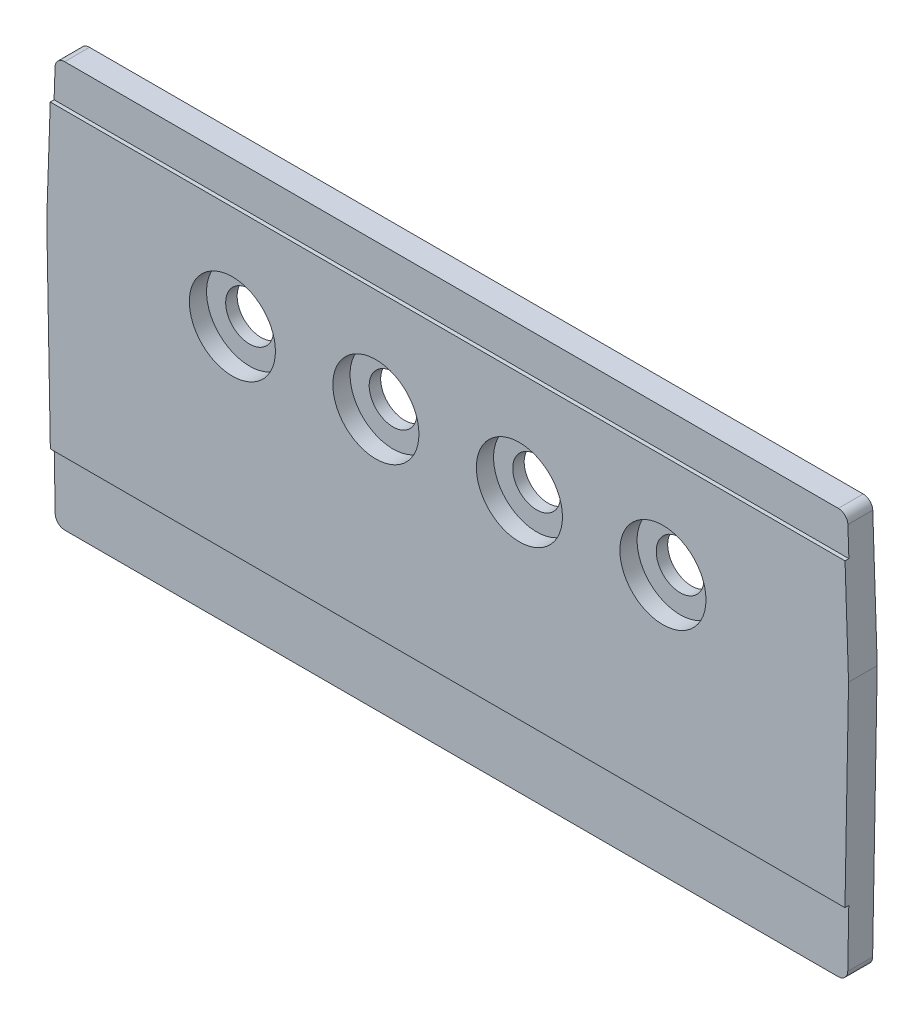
from build123d import *

# Parameters (mm, degrees)
ESQUISSE1_R             = 2.5
BOSS_EXTRU_1_DEPTH      = 3
ESQUISSE2_R             = 4.5
ENL_V_MAT_EXTRU_1_DEPTH = 1.8
ESQUISSE3_W             = 85.37154683
ESQUISSE3_H             = 4
ESQUISSE3_H_2           = 7
ENL_V_MAT_EXTRU_2_DEPTH = 0.4


with BuildPart() as part:
    # Esquisse1 → Boss.-Extru.1 (new body)
    with BuildSketch(Plane.XY):
        with BuildLine():
            Line((1.482048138, 0), (82.317951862, 0))
            ThreePointArc((82.317951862, 0), (83.018625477, 0.286518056), (83.317787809, 0.98188703))
            Line((83.317787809, 0.98188703), (83.8, 27.6))
            Line((83.8, 27.6), (83.332643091, 41.433764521))
            ThreePointArc((83.332643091, 41.433764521), (83.02827999, 42.118945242), (82.333213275, 42.4))
            Line((82.333213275, 42.4), (1.466786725, 42.4))
            ThreePointArc((1.466786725, 42.4), (0.77172001, 42.118945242), (0.467356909, 41.433764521))
            Line((0.467356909, 41.433764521), (0, 27.6))
            Line((0, 27.6), (0.482212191, 0.98188703))
            ThreePointArc((0.482212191, 0.98188703), (0.781374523, 0.286518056), (1.482048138, 0))
        make_face()
        with Locations((19.4, 27.6)):
            Circle(ESQUISSE1_R, mode=Mode.SUBTRACT)
        with Locations((34.4, 27.6)):
            Circle(ESQUISSE1_R, mode=Mode.SUBTRACT)
        with Locations((49.4, 27.6)):
            Circle(ESQUISSE1_R, mode=Mode.SUBTRACT)
        with Locations((64.4, 27.6)):
            Circle(ESQUISSE1_R, mode=Mode.SUBTRACT)
    extrude(amount=BOSS_EXTRU_1_DEPTH)

    # Esquisse2 → Enl_v. mat.-Extru.1 (cut)
    with BuildSketch(Plane.XY.offset(3)):
        with Locations((19.4, 27.6)):
            Circle(ESQUISSE2_R)
        with Locations((34.4, 27.6)):
            Circle(ESQUISSE2_R)
        with Locations((49.4, 27.6)):
            Circle(ESQUISSE2_R)
        with Locations((64.4, 27.6)):
            Circle(ESQUISSE2_R)
    extrude(amount=-ENL_V_MAT_EXTRU_1_DEPTH, mode=Mode.SUBTRACT)

    # Esquisse3 → Enl_v. mat.-Extru.2 (cut)
    with BuildSketch(Plane.XY.offset(3)):
        with Locations((42.055337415, 40.4)):
            Rectangle(ESQUISSE3_W, ESQUISSE3_H)
        with Locations((42.055337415, 3.5)):
            Rectangle(ESQUISSE3_W, ESQUISSE3_H_2)
    extrude(amount=-ENL_V_MAT_EXTRU_2_DEPTH, mode=Mode.SUBTRACT)


solid = part.part
